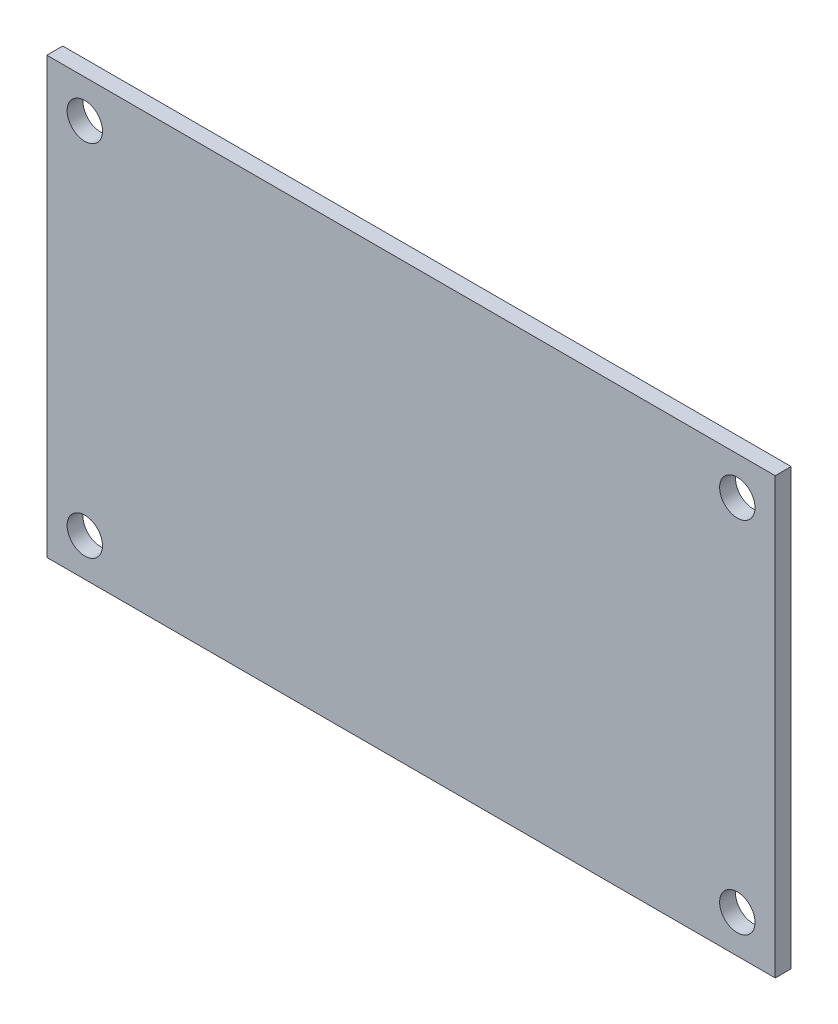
from build123d import *

# Parameters (mm, degrees)
ESQUISSE1_W        = 72
ESQUISSE1_H        = 43
ESQUISSE1_R        = 1.75
BOSS_EXTRU_1_DEPTH = 1.57


with BuildPart() as part:
    # Esquisse1 → Boss.-Extru.1 (new body)
    with BuildSketch(Plane.XY):
        with Locations((-16.858975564, -0.81854928)):
            Rectangle(ESQUISSE1_W, ESQUISSE1_H)
        with Locations((-49.108975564, 16.93145072)):
            Circle(ESQUISSE1_R, mode=Mode.SUBTRACT)
        with Locations((15.391024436, 16.93145072)):
            Circle(ESQUISSE1_R, mode=Mode.SUBTRACT)
        with Locations((-49.108975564, -18.56854928)):
            Circle(ESQUISSE1_R, mode=Mode.SUBTRACT)
        with Locations((15.391024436, -18.56854928)):
            Circle(ESQUISSE1_R, mode=Mode.SUBTRACT)
    extrude(amount=BOSS_EXTRU_1_DEPTH)


solid = part.part
